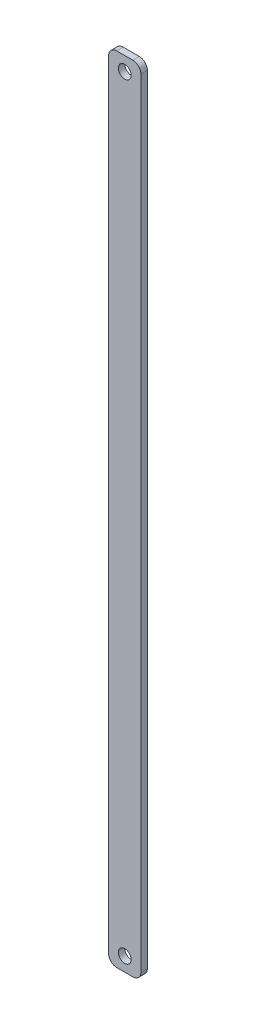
from build123d import *

# Parameters (mm, degrees)
SKETCH1_W           = 8.07
SKETCH1_H           = 1.63
BOSS_EXTRUDE1_DEPTH = 198.37
SKETCH2_R           = 1.6
CUT_EXTRUDE1_DEPTH  = 1.63
FILLET1_R           = 2


with BuildPart() as part:
    # Sketch1 → Boss-Extrude1 (new body)
    with BuildSketch(Plane(origin=(0, 0, 0), x_dir=(1, 0, 0), z_dir=(0, 1, 0))):
        Rectangle(SKETCH1_W, SKETCH1_H)
    extrude(amount=BOSS_EXTRUDE1_DEPTH)

    # Sketch2 → Cut-Extrude1 (cut)
    with BuildSketch(Plane.XY.offset(0.815)):
        with Locations((-0.005, 3.499996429)):
            Circle(SKETCH2_R)
        with Locations((0.005, 194.87)):
            Circle(SKETCH2_R)
    extrude(amount=-CUT_EXTRUDE1_DEPTH, mode=Mode.SUBTRACT)

    # Fillet1
    fillet1_edges = [part.edges().sort_by_distance(p)[0] for p in [
        (-4.035, 198.37, 0),
        (4.035, 198.37, 0),
        (-4.035, 0, 0),
        (4.035, 0, 0),
    ]]
    fillet(fillet1_edges, radius=FILLET1_R)


solid = part.part
